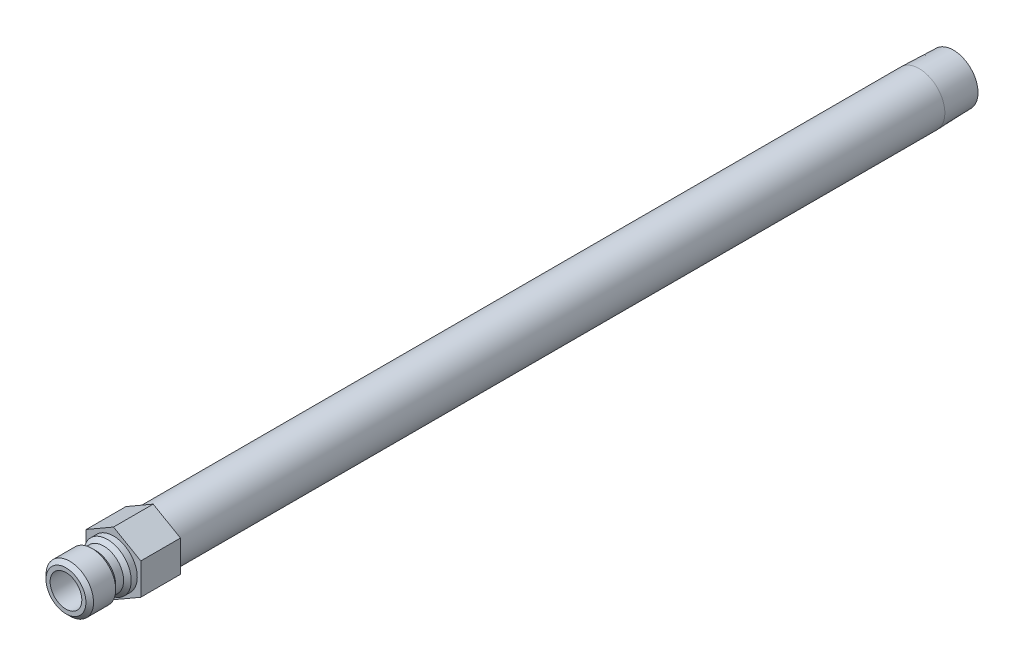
from build123d import *

# Parameters (mm, degrees)
SKETCH2_R           = 2.38125
BOSS_EXTRUDE1_DEPTH = 7.9502


with BuildPart() as part:
    # Sketch1 → Revolve1 (revolve)
    with BuildSketch(Plane(origin=(0, 0, 0), x_dir=(0, 0, -1), z_dir=(1, 0, 0))):
        Polygon((-9.525, 3.175), (-9.525, 4.0005), (-8.763, 4.7625), (-4.318, 4.7625), (-3.556, 4.0005), (-1.9685, 4.0005), (-1.2065, 4.7625), (0, 4.7625), (0, 5.1435), (161.417, 5.1435), (168.275, 4.929188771), (168.275, 2.38125), (0.127, 2.38125), (0.127, 3.175), align=None)
    revolve(axis=Axis((0, 0, 0), (0, 0, 1)))

    # Sketch2 → Boss-Extrude1 (add)
    with BuildSketch(Plane.XY):
        Polygon((-5.461, 3.15290982), (-5.461, -3.15290982), (0, -6.30581964), (5.461, -3.15290982), (5.461, 3.15290982), (0, 6.30581964), align=None)
        with Locations(Location((0, 0, 0), (0, 0, 90))):
            Circle(SKETCH2_R, mode=Mode.SUBTRACT)
    extrude(amount=-BOSS_EXTRUDE1_DEPTH)


solid = part.part
